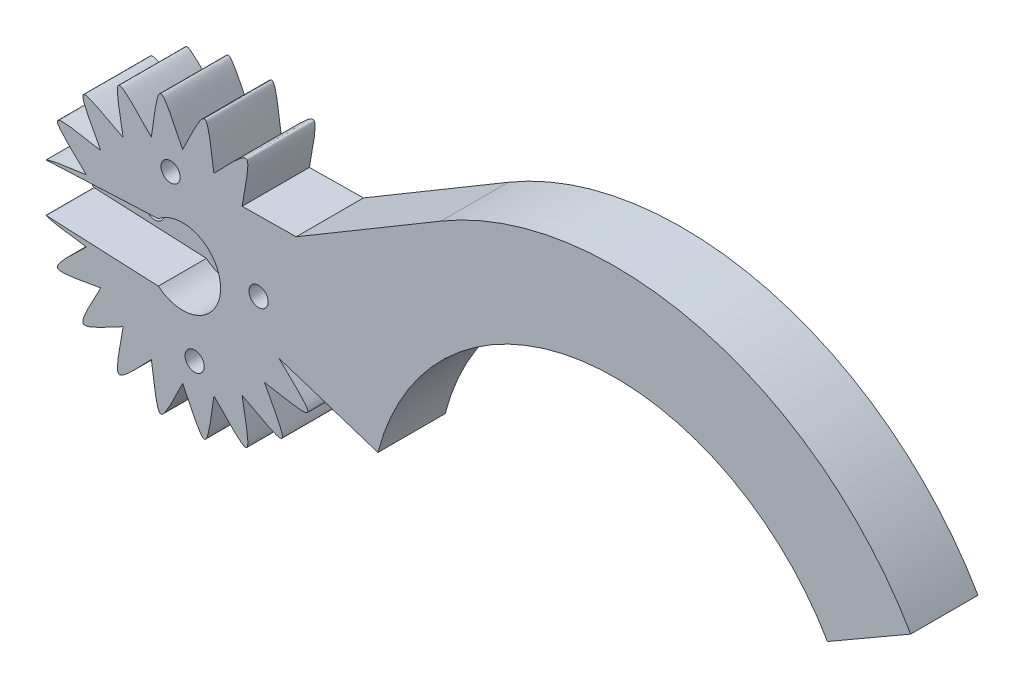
ISO-10303-21;
HEADER;
FILE_DESCRIPTION(('STEP AP214'),'2;1');
FILE_NAME('part.step','',(''),(''),'','','');
FILE_SCHEMA(('AUTOMOTIVE_DESIGN { 1 0 10303 214 1 1 1 1 }'));
ENDSEC;
DATA;
#1=APPLICATION_CONTEXT('core data for automotive mechanical design processes');
#2=APPLICATION_PROTOCOL_DEFINITION('international standard','automotive_design',2000,#1);
#3=PRODUCT_CONTEXT('',#1,'mechanical');
#4=PRODUCT('Part','Part','',(#3));
#5=PRODUCT_RELATED_PRODUCT_CATEGORY('part','',(#4));
#6=PRODUCT_DEFINITION_FORMATION('','',#4);
#7=PRODUCT_DEFINITION_CONTEXT('part definition',#1,'design');
#8=PRODUCT_DEFINITION('design','',#6,#7);
#9=PRODUCT_DEFINITION_SHAPE('','',#8);
#10=(LENGTH_UNIT() NAMED_UNIT(*) SI_UNIT(.MILLI.,.METRE.));
#11=(NAMED_UNIT(*) PLANE_ANGLE_UNIT() SI_UNIT($,.RADIAN.));
#12=(NAMED_UNIT(*) SI_UNIT($,.STERADIAN.) SOLID_ANGLE_UNIT());
#13=UNCERTAINTY_MEASURE_WITH_UNIT(LENGTH_MEASURE(1.E-05),#10,'distance_accuracy_value','');
#14=(GEOMETRIC_REPRESENTATION_CONTEXT(3) GLOBAL_UNCERTAINTY_ASSIGNED_CONTEXT((#13)) GLOBAL_UNIT_ASSIGNED_CONTEXT((#10,
#11,#12)) REPRESENTATION_CONTEXT('',''));
#15=CARTESIAN_POINT('',(0.,0.,0.));
#16=DIRECTION('',(0.,0.,1.));
#17=DIRECTION('',(1.,0.,0.));
#18=AXIS2_PLACEMENT_3D('',#15,#16,#17);
#19=CARTESIAN_POINT('',(-52.9015067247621,11.7485242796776,7.));
#20=DIRECTION('',(0.,0.,-1.));
#21=DIRECTION('',(-1.,0.,0.));
#22=AXIS2_PLACEMENT_3D('',#19,#20,#21);
#23=CYLINDRICAL_SURFACE('',#22,1.);
#24=CARTESIAN_POINT('',(-52.9015067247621,11.7485242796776,0.));
#25=DIRECTION('',(0.,0.,1.));
#26=DIRECTION('',(1.,0.,0.));
#27=AXIS2_PLACEMENT_3D('',#24,#25,#26);
#28=CIRCLE('',#27,1.);
#29=CARTESIAN_POINT('',(-51.9015067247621,11.7485242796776,0.));
#30=VERTEX_POINT('',#29);
#31=EDGE_CURVE('E595',#30,#30,#28,.T.);
#32=ORIENTED_EDGE('',*,*,#31,.F.);
#33=EDGE_LOOP('',(#32));
#34=FACE_BOUND('',#33,.T.);
#35=CARTESIAN_POINT('',(-52.9015067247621,11.7485242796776,2.));
#36=DIRECTION('',(0.,0.,1.));
#37=DIRECTION('',(1.,0.,0.));
#38=AXIS2_PLACEMENT_3D('',#35,#36,#37);
#39=CIRCLE('',#38,1.);
#40=CARTESIAN_POINT('',(-51.9015067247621,11.7485242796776,2.));
#41=VERTEX_POINT('',#40);
#42=EDGE_CURVE('E757',#41,#41,#39,.T.);
#43=ORIENTED_EDGE('',*,*,#42,.T.);
#44=EDGE_LOOP('',(#43));
#45=FACE_BOUND('',#44,.T.);
#46=ADVANCED_FACE('F71',(#34,#45),#23,.F.);
#47=CARTESIAN_POINT('',(-45.0000000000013,13.,7.));
#48=DIRECTION('',(0.,0.,-1.));
#49=DIRECTION('',(-1.,0.,0.));
#50=AXIS2_PLACEMENT_3D('',#47,#48,#49);
#51=CYLINDRICAL_SURFACE('',#50,1.);
#52=CARTESIAN_POINT('',(-45.0000000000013,13.,0.));
#53=DIRECTION('',(0.,0.,1.));
#54=DIRECTION('',(1.,0.,0.));
#55=AXIS2_PLACEMENT_3D('',#52,#53,#54);
#56=CIRCLE('',#55,1.);
#57=CARTESIAN_POINT('',(-44.0000000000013,13.,0.));
#58=VERTEX_POINT('',#57);
#59=EDGE_CURVE('E598',#58,#58,#56,.T.);
#60=ORIENTED_EDGE('',*,*,#59,.F.);
#61=EDGE_LOOP('',(#60));
#62=FACE_BOUND('',#61,.T.);
#63=CARTESIAN_POINT('',(-45.0000000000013,13.,2.));
#64=DIRECTION('',(0.,0.,1.));
#65=DIRECTION('',(1.,0.,0.));
#66=AXIS2_PLACEMENT_3D('',#63,#64,#65);
#67=CIRCLE('',#66,1.);
#68=CARTESIAN_POINT('',(-44.0000000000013,13.,2.));
#69=VERTEX_POINT('',#68);
#70=EDGE_CURVE('E755',#69,#69,#67,.T.);
#71=ORIENTED_EDGE('',*,*,#70,.T.);
#72=EDGE_LOOP('',(#71));
#73=FACE_BOUND('',#72,.T.);
#74=ADVANCED_FACE('F715',(#62,#73),#51,.F.);
#75=CARTESIAN_POINT('',(-55.0142801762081,16.2538368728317,7.));
#76=CARTESIAN_POINT('',(-60.8030134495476,15.5029514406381,7.));
#77=CARTESIAN_POINT('',(-55.5296373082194,12.9999999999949,7.));
#78=(BOUNDED_CURVE() B_SPLINE_CURVE(2,(#75,#76,#77),.UNSPECIFIED.,.F.,
.F.) B_SPLINE_CURVE_WITH_KNOTS((3,3),(0.,1.),
.UNSPECIFIED.) CURVE() GEOMETRIC_REPRESENTATION_ITEM() RATIONAL_B_SPLINE_CURVE((1.,3.,1.)) REPRESENTATION_ITEM(''));
#79=DIRECTION('',(0.,0.,-1.));
#80=VECTOR('',#79,1.);
#81=SURFACE_OF_LINEAR_EXTRUSION('',#78,#80);
#82=CARTESIAN_POINT('',(-55.0142801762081,16.2538368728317,2.));
#83=CARTESIAN_POINT('',(-60.8030134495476,15.5029514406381,2.));
#84=CARTESIAN_POINT('',(-55.5296373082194,12.9999999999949,2.));
#85=(BOUNDED_CURVE() B_SPLINE_CURVE(2,(#82,#83,#84),.UNSPECIFIED.,.F.,
.F.) B_SPLINE_CURVE_WITH_KNOTS((3,3),(0.,1.),
.UNSPECIFIED.) CURVE() GEOMETRIC_REPRESENTATION_ITEM() RATIONAL_B_SPLINE_CURVE((1.,3.,1.)) REPRESENTATION_ITEM(''));
#86=CARTESIAN_POINT('',(-59.2132458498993,15.4943053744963,2.));
#87=VERTEX_POINT('',#86);
#88=CARTESIAN_POINT('',(-55.5296373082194,12.9999999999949,2.));
#89=VERTEX_POINT('',#88);
#90=EDGE_CURVE('E460',#87,#89,#85,.T.);
#91=ORIENTED_EDGE('',*,*,#90,.F.);
#92=DIRECTION('',(0.,0.,-1.));
#93=VECTOR('',#92,1.);
#94=CARTESIAN_POINT('',(-59.2132458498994,15.4943053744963,7.));
#95=LINE('',#94,#93);
#96=CARTESIAN_POINT('',(-59.2132458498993,15.4943053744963,7.));
#97=VERTEX_POINT('',#96);
#98=EDGE_CURVE('E800',#87,#97,#95,.F.);
#99=ORIENTED_EDGE('',*,*,#98,.T.);
#100=CARTESIAN_POINT('',(-55.0142801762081,16.2538368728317,7.));
#101=VERTEX_POINT('',#100);
#102=EDGE_CURVE('E601',#101,#97,#78,.T.);
#103=ORIENTED_EDGE('',*,*,#102,.F.);
#104=DIRECTION('',(0.,0.,-1.));
#105=VECTOR('',#104,1.);
#106=CARTESIAN_POINT('',(-55.0142801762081,16.2538368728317,7.));
#107=LINE('',#106,#105);
#108=CARTESIAN_POINT('',(-55.0142801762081,16.2538368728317,0.));
#109=VERTEX_POINT('',#108);
#110=EDGE_CURVE('E459',#101,#109,#107,.T.);
#111=ORIENTED_EDGE('',*,*,#110,.T.);
#112=CARTESIAN_POINT('',(-55.0142801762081,16.2538368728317,0.));
#113=CARTESIAN_POINT('',(-60.8030134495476,15.5029514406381,0.));
#114=CARTESIAN_POINT('',(-55.5296373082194,12.9999999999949,0.));
#115=(BOUNDED_CURVE() B_SPLINE_CURVE(2,(#112,#113,#114),.UNSPECIFIED.,.F.,
.F.) B_SPLINE_CURVE_WITH_KNOTS((3,3),(0.,1.),
.UNSPECIFIED.) CURVE() GEOMETRIC_REPRESENTATION_ITEM() RATIONAL_B_SPLINE_CURVE((1.,3.,1.)) REPRESENTATION_ITEM(''));
#116=CARTESIAN_POINT('',(-55.5296373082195,12.9999999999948,0.));
#117=VERTEX_POINT('',#116);
#118=EDGE_CURVE('E454',#109,#117,#115,.T.);
#119=ORIENTED_EDGE('',*,*,#118,.T.);
#120=DIRECTION('',(0.,0.,-1.));
#121=VECTOR('',#120,1.);
#122=CARTESIAN_POINT('',(-55.5296373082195,12.9999999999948,7.));
#123=LINE('',#122,#121);
#124=EDGE_CURVE('E80',#89,#117,#123,.T.);
#125=ORIENTED_EDGE('',*,*,#124,.F.);
#126=EDGE_LOOP('',(#91,#99,#103,#111,#119,#125));
#127=FACE_BOUND('',#126,.T.);
#128=ADVANCED_FACE('F73',(#127),#81,.F.);
#129=CARTESIAN_POINT('',(-55.5296373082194,12.9999999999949,7.));
#130=CARTESIAN_POINT('',(-60.8030134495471,10.4970485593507,7.));
#131=CARTESIAN_POINT('',(-55.0142801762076,9.74616312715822,7.));
#132=(BOUNDED_CURVE() B_SPLINE_CURVE(2,(#129,#130,#131),.UNSPECIFIED.,.F.,
.F.) B_SPLINE_CURVE_WITH_KNOTS((3,3),(0.,1.),
.UNSPECIFIED.) CURVE() GEOMETRIC_REPRESENTATION_ITEM() RATIONAL_B_SPLINE_CURVE((1.,3.,1.)) REPRESENTATION_ITEM(''));
#133=DIRECTION('',(0.,0.,-1.));
#134=VECTOR('',#133,1.);
#135=SURFACE_OF_LINEAR_EXTRUSION('',#132,#134);
#136=CARTESIAN_POINT('',(-59.2132458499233,10.5056946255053,7.));
#137=VERTEX_POINT('',#136);
#138=CARTESIAN_POINT('',(-55.0142801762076,9.74616312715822,7.));
#139=VERTEX_POINT('',#138);
#140=EDGE_CURVE('E177',#137,#139,#132,.T.);
#141=ORIENTED_EDGE('',*,*,#140,.F.);
#142=DIRECTION('',(0.,0.,-1.));
#143=VECTOR('',#142,1.);
#144=CARTESIAN_POINT('',(-59.2132458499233,10.5056946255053,7.));
#145=LINE('',#144,#143);
#146=CARTESIAN_POINT('',(-59.2132458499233,10.5056946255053,2.));
#147=VERTEX_POINT('',#146);
#148=EDGE_CURVE('E86',#137,#147,#145,.T.);
#149=ORIENTED_EDGE('',*,*,#148,.T.);
#150=CARTESIAN_POINT('',(-55.5296373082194,12.9999999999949,2.));
#151=CARTESIAN_POINT('',(-60.8030134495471,10.4970485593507,2.));
#152=CARTESIAN_POINT('',(-55.0142801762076,9.74616312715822,2.));
#153=(BOUNDED_CURVE() B_SPLINE_CURVE(2,(#150,#151,#152),.UNSPECIFIED.,.F.,
.F.) B_SPLINE_CURVE_WITH_KNOTS((3,3),(0.,1.),
.UNSPECIFIED.) CURVE() GEOMETRIC_REPRESENTATION_ITEM() RATIONAL_B_SPLINE_CURVE((1.,3.,1.)) REPRESENTATION_ITEM(''));
#154=EDGE_CURVE('E445',#89,#147,#153,.T.);
#155=ORIENTED_EDGE('',*,*,#154,.F.);
#156=ORIENTED_EDGE('',*,*,#124,.T.);
#157=CARTESIAN_POINT('',(-55.5296373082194,12.9999999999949,0.));
#158=CARTESIAN_POINT('',(-60.8030134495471,10.4970485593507,0.));
#159=CARTESIAN_POINT('',(-55.0142801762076,9.74616312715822,0.));
#160=(BOUNDED_CURVE() B_SPLINE_CURVE(2,(#157,#158,#159),.UNSPECIFIED.,.F.,
.F.) B_SPLINE_CURVE_WITH_KNOTS((3,3),(0.,1.),
.UNSPECIFIED.) CURVE() GEOMETRIC_REPRESENTATION_ITEM() RATIONAL_B_SPLINE_CURVE((1.,3.,1.)) REPRESENTATION_ITEM(''));
#161=CARTESIAN_POINT('',(-55.0142801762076,9.74616312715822,0.));
#162=VERTEX_POINT('',#161);
#163=EDGE_CURVE('E443',#117,#162,#160,.T.);
#164=ORIENTED_EDGE('',*,*,#163,.T.);
#165=DIRECTION('',(0.,0.,-1.));
#166=VECTOR('',#165,1.);
#167=CARTESIAN_POINT('',(-55.0142801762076,9.74616312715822,7.));
#168=LINE('',#167,#166);
#169=EDGE_CURVE('E436',#139,#162,#168,.T.);
#170=ORIENTED_EDGE('',*,*,#169,.F.);
#171=EDGE_LOOP('',(#141,#149,#155,#156,#164,#170));
#172=FACE_BOUND('',#171,.T.);
#173=ADVANCED_FACE('F442',(#172),#135,.F.);
#174=CARTESIAN_POINT('',(-55.0142801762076,9.74616312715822,7.));
#175=CARTESIAN_POINT('',(-59.2561043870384,5.7361520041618,7.));
#176=CARTESIAN_POINT('',(-53.5186555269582,6.81083447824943,7.));
#177=(BOUNDED_CURVE() B_SPLINE_CURVE(2,(#174,#175,#176),.UNSPECIFIED.,.F.,
.F.) B_SPLINE_CURVE_WITH_KNOTS((3,3),(0.,1.),
.UNSPECIFIED.) CURVE() GEOMETRIC_REPRESENTATION_ITEM() RATIONAL_B_SPLINE_CURVE((1.,3.,1.)) REPRESENTATION_ITEM(''));
#178=DIRECTION('',(0.,0.,-1.));
#179=VECTOR('',#178,1.);
#180=SURFACE_OF_LINEAR_EXTRUSION('',#177,#179);
#181=CARTESIAN_POINT('',(-55.0142801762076,9.74616312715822,0.));
#182=CARTESIAN_POINT('',(-59.2561043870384,5.7361520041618,0.));
#183=CARTESIAN_POINT('',(-53.5186555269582,6.81083447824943,0.));
#184=(BOUNDED_CURVE() B_SPLINE_CURVE(2,(#181,#182,#183),.UNSPECIFIED.,.F.,
.F.) B_SPLINE_CURVE_WITH_KNOTS((3,3),(0.,1.),
.UNSPECIFIED.) CURVE() GEOMETRIC_REPRESENTATION_ITEM() RATIONAL_B_SPLINE_CURVE((1.,3.,1.)) REPRESENTATION_ITEM(''));
#185=CARTESIAN_POINT('',(-53.5186555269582,6.81083447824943,0.));
#186=VERTEX_POINT('',#185);
#187=EDGE_CURVE('E456',#162,#186,#184,.T.);
#188=ORIENTED_EDGE('',*,*,#187,.T.);
#189=DIRECTION('',(0.,0.,-1.));
#190=VECTOR('',#189,1.);
#191=CARTESIAN_POINT('',(-53.5186555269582,6.81083447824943,7.));
#192=LINE('',#191,#190);
#193=CARTESIAN_POINT('',(-53.5186555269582,6.81083447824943,7.));
#194=VERTEX_POINT('',#193);
#195=EDGE_CURVE('E433',#194,#186,#192,.T.);
#196=ORIENTED_EDGE('',*,*,#195,.F.);
#197=EDGE_CURVE('E653',#139,#194,#177,.T.);
#198=ORIENTED_EDGE('',*,*,#197,.F.);
#199=ORIENTED_EDGE('',*,*,#169,.T.);
#200=EDGE_LOOP('',(#188,#196,#198,#199));
#201=FACE_BOUND('',#200,.T.);
#202=ADVANCED_FACE('F652',(#201),#180,.F.);
#203=CARTESIAN_POINT('',(-53.5186555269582,6.81083447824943,7.));
#204=CARTESIAN_POINT('',(-56.313708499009,1.68629150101,7.));
#205=CARTESIAN_POINT('',(-51.1891655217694,4.48134447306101,7.));
#206=(BOUNDED_CURVE() B_SPLINE_CURVE(2,(#203,#204,#205),.UNSPECIFIED.,.F.,
.F.) B_SPLINE_CURVE_WITH_KNOTS((3,3),(0.,1.),
.UNSPECIFIED.) CURVE() GEOMETRIC_REPRESENTATION_ITEM() RATIONAL_B_SPLINE_CURVE((1.,3.,1.)) REPRESENTATION_ITEM(''));
#207=DIRECTION('',(0.,0.,-1.));
#208=VECTOR('',#207,1.);
#209=SURFACE_OF_LINEAR_EXTRUSION('',#206,#208);
#210=CARTESIAN_POINT('',(-53.5186555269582,6.81083447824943,0.));
#211=CARTESIAN_POINT('',(-56.313708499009,1.68629150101,0.));
#212=CARTESIAN_POINT('',(-51.1891655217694,4.48134447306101,0.));
#213=(BOUNDED_CURVE() B_SPLINE_CURVE(2,(#210,#211,#212),.UNSPECIFIED.,.F.,
.F.) B_SPLINE_CURVE_WITH_KNOTS((3,3),(0.,1.),
.UNSPECIFIED.) CURVE() GEOMETRIC_REPRESENTATION_ITEM() RATIONAL_B_SPLINE_CURVE((1.,3.,1.)) REPRESENTATION_ITEM(''));
#214=CARTESIAN_POINT('',(-51.1891655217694,4.48134447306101,0.));
#215=VERTEX_POINT('',#214);
#216=EDGE_CURVE('E481',#186,#215,#213,.T.);
#217=ORIENTED_EDGE('',*,*,#216,.T.);
#218=DIRECTION('',(0.,0.,-1.));
#219=VECTOR('',#218,1.);
#220=CARTESIAN_POINT('',(-51.1891655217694,4.48134447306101,7.));
#221=LINE('',#220,#219);
#222=CARTESIAN_POINT('',(-51.1891655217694,4.48134447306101,7.));
#223=VERTEX_POINT('',#222);
#224=EDGE_CURVE('E430',#223,#215,#221,.T.);
#225=ORIENTED_EDGE('',*,*,#224,.F.);
#226=EDGE_CURVE('E649',#194,#223,#206,.T.);
#227=ORIENTED_EDGE('',*,*,#226,.F.);
#228=ORIENTED_EDGE('',*,*,#195,.T.);
#229=EDGE_LOOP('',(#217,#225,#227,#228));
#230=FACE_BOUND('',#229,.T.);
#231=ADVANCED_FACE('F646',(#230),#209,.F.);
#232=CARTESIAN_POINT('',(-51.1891655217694,4.48134447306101,7.));
#233=CARTESIAN_POINT('',(-52.2638479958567,-1.25610438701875,7.));
#234=CARTESIAN_POINT('',(-48.253836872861,2.98571982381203,7.));
#235=(BOUNDED_CURVE() B_SPLINE_CURVE(2,(#232,#233,#234),.UNSPECIFIED.,.F.,
.F.) B_SPLINE_CURVE_WITH_KNOTS((3,3),(0.,1.),
.UNSPECIFIED.) CURVE() GEOMETRIC_REPRESENTATION_ITEM() RATIONAL_B_SPLINE_CURVE((1.,3.,1.)) REPRESENTATION_ITEM(''));
#236=DIRECTION('',(0.,0.,-1.));
#237=VECTOR('',#236,1.);
#238=SURFACE_OF_LINEAR_EXTRUSION('',#235,#237);
#239=CARTESIAN_POINT('',(-51.1891655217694,4.48134447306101,0.));
#240=CARTESIAN_POINT('',(-52.2638479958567,-1.25610438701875,0.));
#241=CARTESIAN_POINT('',(-48.253836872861,2.98571982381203,0.));
#242=(BOUNDED_CURVE() B_SPLINE_CURVE(2,(#239,#240,#241),.UNSPECIFIED.,.F.,
.F.) B_SPLINE_CURVE_WITH_KNOTS((3,3),(0.,1.),
.UNSPECIFIED.) CURVE() GEOMETRIC_REPRESENTATION_ITEM() RATIONAL_B_SPLINE_CURVE((1.,3.,1.)) REPRESENTATION_ITEM(''));
#243=CARTESIAN_POINT('',(-48.253836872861,2.98571982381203,0.));
#244=VERTEX_POINT('',#243);
#245=EDGE_CURVE('E488',#215,#244,#242,.T.);
#246=ORIENTED_EDGE('',*,*,#245,.T.);
#247=DIRECTION('',(0.,0.,-1.));
#248=VECTOR('',#247,1.);
#249=CARTESIAN_POINT('',(-48.253836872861,2.98571982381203,7.));
#250=LINE('',#249,#248);
#251=CARTESIAN_POINT('',(-48.253836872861,2.98571982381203,7.));
#252=VERTEX_POINT('',#251);
#253=EDGE_CURVE('E427',#252,#244,#250,.T.);
#254=ORIENTED_EDGE('',*,*,#253,.F.);
#255=EDGE_CURVE('E643',#223,#252,#235,.T.);
#256=ORIENTED_EDGE('',*,*,#255,.F.);
#257=ORIENTED_EDGE('',*,*,#224,.T.);
#258=EDGE_LOOP('',(#246,#254,#256,#257));
#259=FACE_BOUND('',#258,.T.);
#260=ADVANCED_FACE('F642',(#259),#238,.F.);
#261=CARTESIAN_POINT('',(-48.253836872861,2.98571982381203,7.));
#262=CARTESIAN_POINT('',(-47.5029514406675,-2.80301344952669,7.));
#263=CARTESIAN_POINT('',(-45.0000000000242,2.47036269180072,7.));
#264=(BOUNDED_CURVE() B_SPLINE_CURVE(2,(#261,#262,#263),.UNSPECIFIED.,.F.,
.F.) B_SPLINE_CURVE_WITH_KNOTS((3,3),(0.,1.),
.UNSPECIFIED.) CURVE() GEOMETRIC_REPRESENTATION_ITEM() RATIONAL_B_SPLINE_CURVE((1.,3.,1.)) REPRESENTATION_ITEM(''));
#265=DIRECTION('',(0.,0.,-1.));
#266=VECTOR('',#265,1.);
#267=SURFACE_OF_LINEAR_EXTRUSION('',#264,#266);
#268=CARTESIAN_POINT('',(-48.253836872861,2.98571982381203,0.));
#269=CARTESIAN_POINT('',(-47.5029514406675,-2.80301344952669,0.));
#270=CARTESIAN_POINT('',(-45.0000000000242,2.47036269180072,0.));
#271=(BOUNDED_CURVE() B_SPLINE_CURVE(2,(#268,#269,#270),.UNSPECIFIED.,.F.,
.F.) B_SPLINE_CURVE_WITH_KNOTS((3,3),(0.,1.),
.UNSPECIFIED.) CURVE() GEOMETRIC_REPRESENTATION_ITEM() RATIONAL_B_SPLINE_CURVE((1.,3.,1.)) REPRESENTATION_ITEM(''));
#272=CARTESIAN_POINT('',(-45.0000000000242,2.47036269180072,0.));
#273=VERTEX_POINT('',#272);
#274=EDGE_CURVE('E495',#244,#273,#271,.T.);
#275=ORIENTED_EDGE('',*,*,#274,.T.);
#276=DIRECTION('',(0.,0.,-1.));
#277=VECTOR('',#276,1.);
#278=CARTESIAN_POINT('',(-45.0000000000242,2.47036269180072,7.));
#279=LINE('',#278,#277);
#280=CARTESIAN_POINT('',(-45.0000000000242,2.47036269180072,7.));
#281=VERTEX_POINT('',#280);
#282=EDGE_CURVE('E424',#281,#273,#279,.T.);
#283=ORIENTED_EDGE('',*,*,#282,.F.);
#284=EDGE_CURVE('E638',#252,#281,#264,.T.);
#285=ORIENTED_EDGE('',*,*,#284,.F.);
#286=ORIENTED_EDGE('',*,*,#253,.T.);
#287=EDGE_LOOP('',(#275,#283,#285,#286));
#288=FACE_BOUND('',#287,.T.);
#289=ADVANCED_FACE('F637',(#288),#267,.F.);
#290=CARTESIAN_POINT('',(-45.0000000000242,2.47036269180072,7.));
#291=CARTESIAN_POINT('',(-42.4970485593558,-2.80301344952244,7.));
#292=CARTESIAN_POINT('',(-41.7461631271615,2.98571982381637,7.));
#293=(BOUNDED_CURVE() B_SPLINE_CURVE(2,(#290,#291,#292),.UNSPECIFIED.,.F.,
.F.) B_SPLINE_CURVE_WITH_KNOTS((3,3),(0.,1.),
.UNSPECIFIED.) CURVE() GEOMETRIC_REPRESENTATION_ITEM() RATIONAL_B_SPLINE_CURVE((1.,3.,1.)) REPRESENTATION_ITEM(''));
#294=DIRECTION('',(0.,0.,-1.));
#295=VECTOR('',#294,1.);
#296=SURFACE_OF_LINEAR_EXTRUSION('',#293,#295);
#297=CARTESIAN_POINT('',(-45.0000000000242,2.47036269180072,0.));
#298=CARTESIAN_POINT('',(-42.4970485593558,-2.80301344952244,0.));
#299=CARTESIAN_POINT('',(-41.7461631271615,2.98571982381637,0.));
#300=(BOUNDED_CURVE() B_SPLINE_CURVE(2,(#297,#298,#299),.UNSPECIFIED.,.F.,
.F.) B_SPLINE_CURVE_WITH_KNOTS((3,3),(0.,1.),
.UNSPECIFIED.) CURVE() GEOMETRIC_REPRESENTATION_ITEM() RATIONAL_B_SPLINE_CURVE((1.,3.,1.)) REPRESENTATION_ITEM(''));
#301=CARTESIAN_POINT('',(-41.7461631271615,2.98571982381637,0.));
#302=VERTEX_POINT('',#301);
#303=EDGE_CURVE('E502',#273,#302,#300,.T.);
#304=ORIENTED_EDGE('',*,*,#303,.T.);
#305=DIRECTION('',(0.,0.,-1.));
#306=VECTOR('',#305,1.);
#307=CARTESIAN_POINT('',(-41.7461631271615,2.98571982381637,7.));
#308=LINE('',#307,#306);
#309=CARTESIAN_POINT('',(-41.7461631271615,2.98571982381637,7.));
#310=VERTEX_POINT('',#309);
#311=EDGE_CURVE('E421',#310,#302,#308,.T.);
#312=ORIENTED_EDGE('',*,*,#311,.F.);
#313=EDGE_CURVE('E634',#281,#310,#293,.T.);
#314=ORIENTED_EDGE('',*,*,#313,.F.);
#315=ORIENTED_EDGE('',*,*,#282,.T.);
#316=EDGE_LOOP('',(#304,#312,#314,#315));
#317=FACE_BOUND('',#316,.T.);
#318=ADVANCED_FACE('F631',(#317),#296,.F.);
#319=CARTESIAN_POINT('',(-41.7461631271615,2.98571982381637,7.));
#320=CARTESIAN_POINT('',(-37.736152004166,-1.2561043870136,7.));
#321=CARTESIAN_POINT('',(-38.8108344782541,4.48134447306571,7.));
#322=(BOUNDED_CURVE() B_SPLINE_CURVE(2,(#319,#320,#321),.UNSPECIFIED.,.F.,
.F.) B_SPLINE_CURVE_WITH_KNOTS((3,3),(0.,1.),
.UNSPECIFIED.) CURVE() GEOMETRIC_REPRESENTATION_ITEM() RATIONAL_B_SPLINE_CURVE((1.,3.,1.)) REPRESENTATION_ITEM(''));
#323=DIRECTION('',(0.,0.,-1.));
#324=VECTOR('',#323,1.);
#325=SURFACE_OF_LINEAR_EXTRUSION('',#322,#324);
#326=CARTESIAN_POINT('',(-41.7461631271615,2.98571982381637,0.));
#327=CARTESIAN_POINT('',(-37.736152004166,-1.2561043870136,0.));
#328=CARTESIAN_POINT('',(-38.8108344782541,4.48134447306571,0.));
#329=(BOUNDED_CURVE() B_SPLINE_CURVE(2,(#326,#327,#328),.UNSPECIFIED.,.F.,
.F.) B_SPLINE_CURVE_WITH_KNOTS((3,3),(0.,1.),
.UNSPECIFIED.) CURVE() GEOMETRIC_REPRESENTATION_ITEM() RATIONAL_B_SPLINE_CURVE((1.,3.,1.)) REPRESENTATION_ITEM(''));
#330=CARTESIAN_POINT('',(-38.8108344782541,4.48134447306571,0.));
#331=VERTEX_POINT('',#330);
#332=EDGE_CURVE('E509',#302,#331,#329,.T.);
#333=ORIENTED_EDGE('',*,*,#332,.T.);
#334=DIRECTION('',(0.,0.,-1.));
#335=VECTOR('',#334,1.);
#336=CARTESIAN_POINT('',(-38.8108344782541,4.48134447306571,7.));
#337=LINE('',#336,#335);
#338=CARTESIAN_POINT('',(-38.8108344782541,4.48134447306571,7.));
#339=VERTEX_POINT('',#338);
#340=EDGE_CURVE('E418',#339,#331,#337,.T.);
#341=ORIENTED_EDGE('',*,*,#340,.F.);
#342=EDGE_CURVE('E625',#310,#339,#322,.T.);
#343=ORIENTED_EDGE('',*,*,#342,.F.);
#344=ORIENTED_EDGE('',*,*,#311,.T.);
#345=EDGE_LOOP('',(#333,#341,#343,#344));
#346=FACE_BOUND('',#345,.T.);
#347=ADVANCED_FACE('F624',(#346),#325,.F.);
#348=CARTESIAN_POINT('',(-38.8108344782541,4.48134447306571,7.));
#349=CARTESIAN_POINT('',(-33.6862915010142,1.68629150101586,7.));
#350=CARTESIAN_POINT('',(-36.4813444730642,6.8108344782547,7.));
#351=(BOUNDED_CURVE() B_SPLINE_CURVE(2,(#348,#349,#350),.UNSPECIFIED.,.F.,
.F.) B_SPLINE_CURVE_WITH_KNOTS((3,3),(0.,1.),
.UNSPECIFIED.) CURVE() GEOMETRIC_REPRESENTATION_ITEM() RATIONAL_B_SPLINE_CURVE((1.,3.,1.)) REPRESENTATION_ITEM(''));
#352=DIRECTION('',(0.,0.,-1.));
#353=VECTOR('',#352,1.);
#354=SURFACE_OF_LINEAR_EXTRUSION('',#351,#353);
#355=CARTESIAN_POINT('',(-38.8108344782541,4.48134447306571,0.));
#356=CARTESIAN_POINT('',(-33.6862915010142,1.68629150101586,0.));
#357=CARTESIAN_POINT('',(-36.4813444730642,6.8108344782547,0.));
#358=(BOUNDED_CURVE() B_SPLINE_CURVE(2,(#355,#356,#357),.UNSPECIFIED.,.F.,
.F.) B_SPLINE_CURVE_WITH_KNOTS((3,3),(0.,1.),
.UNSPECIFIED.) CURVE() GEOMETRIC_REPRESENTATION_ITEM() RATIONAL_B_SPLINE_CURVE((1.,3.,1.)) REPRESENTATION_ITEM(''));
#359=CARTESIAN_POINT('',(-36.4813444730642,6.8108344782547,0.));
#360=VERTEX_POINT('',#359);
#361=EDGE_CURVE('E516',#331,#360,#358,.T.);
#362=ORIENTED_EDGE('',*,*,#361,.T.);
#363=DIRECTION('',(0.,0.,-1.));
#364=VECTOR('',#363,1.);
#365=CARTESIAN_POINT('',(-36.4813444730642,6.8108344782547,7.));
#366=LINE('',#365,#364);
#367=CARTESIAN_POINT('',(-36.4813444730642,6.8108344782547,7.));
#368=VERTEX_POINT('',#367);
#369=EDGE_CURVE('E415',#368,#360,#366,.T.);
#370=ORIENTED_EDGE('',*,*,#369,.F.);
#371=EDGE_CURVE('E356',#339,#368,#351,.T.);
#372=ORIENTED_EDGE('',*,*,#371,.F.);
#373=ORIENTED_EDGE('',*,*,#340,.T.);
#374=EDGE_LOOP('',(#362,#370,#372,#373));
#375=FACE_BOUND('',#374,.T.);
#376=ADVANCED_FACE('F346',(#375),#354,.F.);
#377=CARTESIAN_POINT('',(-36.4813444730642,6.8108344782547,7.));
#378=CARTESIAN_POINT('',(-30.7438956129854,5.73615200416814,7.));
#379=CARTESIAN_POINT('',(-34.9857198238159,9.74616312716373,7.));
#380=(BOUNDED_CURVE() B_SPLINE_CURVE(2,(#377,#378,#379),.UNSPECIFIED.,.F.,
.F.) B_SPLINE_CURVE_WITH_KNOTS((3,3),(0.,1.),
.UNSPECIFIED.) CURVE() GEOMETRIC_REPRESENTATION_ITEM() RATIONAL_B_SPLINE_CURVE((1.,3.,1.)) REPRESENTATION_ITEM(''));
#381=DIRECTION('',(0.,0.,-1.));
#382=VECTOR('',#381,1.);
#383=SURFACE_OF_LINEAR_EXTRUSION('',#380,#382);
#384=CARTESIAN_POINT('',(-36.4813444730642,6.8108344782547,0.));
#385=CARTESIAN_POINT('',(-30.7438956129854,5.73615200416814,0.));
#386=CARTESIAN_POINT('',(-34.9857198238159,9.74616312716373,0.));
#387=(BOUNDED_CURVE() B_SPLINE_CURVE(2,(#384,#385,#386),.UNSPECIFIED.,.F.,
.F.) B_SPLINE_CURVE_WITH_KNOTS((3,3),(0.,1.),
.UNSPECIFIED.) CURVE() GEOMETRIC_REPRESENTATION_ITEM() RATIONAL_B_SPLINE_CURVE((1.,3.,1.)) REPRESENTATION_ITEM(''));
#388=CARTESIAN_POINT('',(-34.9857198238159,9.74616312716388,0.));
#389=VERTEX_POINT('',#388);
#390=EDGE_CURVE('E523',#360,#389,#387,.T.);
#391=ORIENTED_EDGE('',*,*,#390,.T.);
#392=DIRECTION('',(0.,0.,-1.));
#393=VECTOR('',#392,1.);
#394=CARTESIAN_POINT('',(-34.9857198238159,9.74616312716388,7.));
#395=LINE('',#394,#393);
#396=CARTESIAN_POINT('',(-34.9857198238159,9.74616312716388,7.));
#397=VERTEX_POINT('',#396);
#398=EDGE_CURVE('E413',#397,#389,#395,.T.);
#399=ORIENTED_EDGE('',*,*,#398,.F.);
#400=EDGE_CURVE('E350',#368,#397,#380,.T.);
#401=ORIENTED_EDGE('',*,*,#400,.F.);
#402=ORIENTED_EDGE('',*,*,#369,.T.);
#403=EDGE_LOOP('',(#391,#399,#401,#402));
#404=FACE_BOUND('',#403,.T.);
#405=ADVANCED_FACE('F341',(#404),#383,.F.);
#406=CARTESIAN_POINT('',(-0.476513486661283,-1.46655771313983,7.));
#407=DIRECTION('',(-0.309016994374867,-0.95105651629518,0.));
#408=DIRECTION('',(0.95105651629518,-0.309016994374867,0.));
#409=AXIS2_PLACEMENT_3D('',#406,#407,#408);
#410=PLANE('',#409);
#411=DIRECTION('',(-0.95105651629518,0.309016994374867,0.));
#412=VECTOR('',#411,1.);
#413=CARTESIAN_POINT('',(-0.476513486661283,-1.46655771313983,0.));
#414=LINE('',#413,#412);
#415=CARTESIAN_POINT('',(-24.6840713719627,6.39895464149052,0.));
#416=VERTEX_POINT('',#415);
#417=EDGE_CURVE('E531',#416,#389,#414,.T.);
#418=ORIENTED_EDGE('',*,*,#417,.F.);
#419=DIRECTION('',(0.,0.,-1.));
#420=VECTOR('',#419,1.);
#421=CARTESIAN_POINT('',(-24.6840713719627,6.39895464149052,7.));
#422=LINE('',#421,#420);
#423=CARTESIAN_POINT('',(-24.6840713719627,6.39895464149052,7.));
#424=VERTEX_POINT('',#423);
#425=EDGE_CURVE('E411',#424,#416,#422,.T.);
#426=ORIENTED_EDGE('',*,*,#425,.F.);
#427=DIRECTION('',(-0.95105651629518,0.309016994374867,0.));
#428=VECTOR('',#427,1.);
#429=CARTESIAN_POINT('',(-0.476513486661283,-1.46655771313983,7.));
#430=LINE('',#429,#428);
#431=EDGE_CURVE('E355',#424,#397,#430,.T.);
#432=ORIENTED_EDGE('',*,*,#431,.T.);
#433=ORIENTED_EDGE('',*,*,#398,.T.);
#434=EDGE_LOOP('',(#418,#426,#432,#433));
#435=FACE_BOUND('',#434,.T.);
#436=ADVANCED_FACE('F337',(#435),#410,.T.);
#437=CARTESIAN_POINT('',(0.,0.,7.));
#438=DIRECTION('',(0.,0.,-1.));
#439=DIRECTION('',(-1.,0.,0.));
#440=AXIS2_PLACEMENT_3D('',#437,#438,#439);
#441=CYLINDRICAL_SURFACE('',#440,25.5);
#442=CARTESIAN_POINT('',(0.,0.,0.));
#443=DIRECTION('',(0.,0.,1.));
#444=DIRECTION('',(1.,0.,0.));
#445=AXIS2_PLACEMENT_3D('',#442,#443,#444);
#446=CIRCLE('',#445,25.5);
#447=CARTESIAN_POINT('',(22.0836477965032,12.7499999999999,0.));
#448=VERTEX_POINT('',#447);
#449=EDGE_CURVE('E537',#448,#416,#446,.T.);
#450=ORIENTED_EDGE('',*,*,#449,.F.);
#451=DIRECTION('',(0.,0.,-1.));
#452=VECTOR('',#451,1.);
#453=CARTESIAN_POINT('',(22.0836477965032,12.7499999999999,7.));
#454=LINE('',#453,#452);
#455=CARTESIAN_POINT('',(22.0836477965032,12.7499999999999,7.));
#456=VERTEX_POINT('',#455);
#457=EDGE_CURVE('E409',#456,#448,#454,.T.);
#458=ORIENTED_EDGE('',*,*,#457,.F.);
#459=CARTESIAN_POINT('',(0.,0.,7.));
#460=DIRECTION('',(0.,0.,1.));
#461=DIRECTION('',(1.,0.,0.));
#462=AXIS2_PLACEMENT_3D('',#459,#460,#461);
#463=CIRCLE('',#462,25.5);
#464=EDGE_CURVE('E366',#456,#424,#463,.T.);
#465=ORIENTED_EDGE('',*,*,#464,.T.);
#466=ORIENTED_EDGE('',*,*,#425,.T.);
#467=EDGE_LOOP('',(#450,#458,#465,#466));
#468=FACE_BOUND('',#467,.T.);
#469=ADVANCED_FACE('F333',(#468),#441,.F.);
#470=CARTESIAN_POINT('',(0.,0.,7.));
#471=DIRECTION('',(-0.499999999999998,0.86602540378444,0.));
#472=DIRECTION('',(-0.86602540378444,-0.499999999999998,0.));
#473=AXIS2_PLACEMENT_3D('',#470,#471,#472);
#474=PLANE('',#473);
#475=DIRECTION('',(0.86602540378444,0.499999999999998,0.));
#476=VECTOR('',#475,1.);
#477=CARTESIAN_POINT('',(0.,0.,0.));
#478=LINE('',#477,#476);
#479=CARTESIAN_POINT('',(30.7439018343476,17.7499999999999,0.));
#480=VERTEX_POINT('',#479);
#481=EDGE_CURVE('E540',#448,#480,#478,.T.);
#482=ORIENTED_EDGE('',*,*,#481,.T.);
#483=DIRECTION('',(0.,0.,-1.));
#484=VECTOR('',#483,1.);
#485=CARTESIAN_POINT('',(30.7439018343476,17.7499999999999,7.));
#486=LINE('',#485,#484);
#487=CARTESIAN_POINT('',(30.7439018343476,17.7499999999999,7.));
#488=VERTEX_POINT('',#487);
#489=EDGE_CURVE('E406',#488,#480,#486,.T.);
#490=ORIENTED_EDGE('',*,*,#489,.F.);
#491=DIRECTION('',(0.86602540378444,0.499999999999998,0.));
#492=VECTOR('',#491,1.);
#493=CARTESIAN_POINT('',(0.,0.,7.));
#494=LINE('',#493,#492);
#495=EDGE_CURVE('E369',#456,#488,#494,.T.);
#496=ORIENTED_EDGE('',*,*,#495,.F.);
#497=ORIENTED_EDGE('',*,*,#457,.T.);
#498=EDGE_LOOP('',(#482,#490,#496,#497));
#499=FACE_BOUND('',#498,.T.);
#500=ADVANCED_FACE('F329',(#499),#474,.F.);
#501=CARTESIAN_POINT('',(0.,0.,7.));
#502=DIRECTION('',(0.,0.,-1.));
#503=DIRECTION('',(-1.,0.,0.));
#504=AXIS2_PLACEMENT_3D('',#501,#502,#503);
#505=CYLINDRICAL_SURFACE('',#504,35.5);
#506=CARTESIAN_POINT('',(0.,0.,0.));
#507=DIRECTION('',(0.,0.,1.));
#508=DIRECTION('',(1.,0.,0.));
#509=AXIS2_PLACEMENT_3D('',#506,#507,#508);
#510=CIRCLE('',#509,35.5);
#511=CARTESIAN_POINT('',(-18.1223197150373,30.5259156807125,0.));
#512=VERTEX_POINT('',#511);
#513=EDGE_CURVE('E542',#480,#512,#510,.T.);
#514=ORIENTED_EDGE('',*,*,#513,.T.);
#515=DIRECTION('',(0.,0.,-1.));
#516=VECTOR('',#515,1.);
#517=CARTESIAN_POINT('',(-18.1223197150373,30.5259156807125,7.));
#518=LINE('',#517,#516);
#519=CARTESIAN_POINT('',(-18.1223197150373,30.5259156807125,7.));
#520=VERTEX_POINT('',#519);
#521=EDGE_CURVE('E404',#520,#512,#518,.T.);
#522=ORIENTED_EDGE('',*,*,#521,.F.);
#523=CARTESIAN_POINT('',(0.,0.,7.));
#524=DIRECTION('',(0.,0.,1.));
#525=DIRECTION('',(1.,0.,0.));
#526=AXIS2_PLACEMENT_3D('',#523,#524,#525);
#527=CIRCLE('',#526,35.5);
#528=EDGE_CURVE('E371',#488,#520,#527,.T.);
#529=ORIENTED_EDGE('',*,*,#528,.F.);
#530=ORIENTED_EDGE('',*,*,#489,.T.);
#531=EDGE_LOOP('',(#514,#522,#529,#530));
#532=FACE_BOUND('',#531,.T.);
#533=ADVANCED_FACE('F325',(#532),#505,.T.);
#534=CARTESIAN_POINT('',(-18.1223197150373,30.5259156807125,7.));
#535=DIRECTION('',(-0.510487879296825,0.859884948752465,0.));
#536=DIRECTION('',(-0.859884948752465,-0.510487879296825,0.));
#537=AXIS2_PLACEMENT_3D('',#534,#535,#536);
#538=PLANE('',#537);
#539=DIRECTION('',(0.859884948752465,0.510487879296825,0.));
#540=VECTOR('',#539,1.);
#541=CARTESIAN_POINT('',(-18.1223197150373,30.5259156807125,0.));
#542=LINE('',#541,#540);
#543=CARTESIAN_POINT('',(-33.1883518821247,21.5816646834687,0.));
#544=VERTEX_POINT('',#543);
#545=EDGE_CURVE('E545',#544,#512,#542,.T.);
#546=ORIENTED_EDGE('',*,*,#545,.F.);
#547=DIRECTION('',(0.,0.,-1.));
#548=VECTOR('',#547,1.);
#549=CARTESIAN_POINT('',(-33.1883518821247,21.5816646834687,7.));
#550=LINE('',#549,#548);
#551=CARTESIAN_POINT('',(-33.1883518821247,21.5816646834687,7.));
#552=VERTEX_POINT('',#551);
#553=EDGE_CURVE('E384',#552,#544,#550,.T.);
#554=ORIENTED_EDGE('',*,*,#553,.F.);
#555=DIRECTION('',(0.859884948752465,0.510487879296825,0.));
#556=VECTOR('',#555,1.);
#557=CARTESIAN_POINT('',(-18.1223197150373,30.5259156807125,7.));
#558=LINE('',#557,#556);
#559=EDGE_CURVE('E372',#552,#520,#558,.T.);
#560=ORIENTED_EDGE('',*,*,#559,.T.);
#561=ORIENTED_EDGE('',*,*,#521,.T.);
#562=EDGE_LOOP('',(#546,#554,#560,#561));
#563=FACE_BOUND('',#562,.T.);
#564=ADVANCED_FACE('F321',(#563),#538,.T.);
#565=CARTESIAN_POINT('',(-0.245995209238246,21.9508379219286,7.));
#566=DIRECTION('',(0.0112059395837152,-0.999937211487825,0.));
#567=DIRECTION('',(0.999937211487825,0.0112059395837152,0.));
#568=AXIS2_PLACEMENT_3D('',#565,#566,#567);
#569=PLANE('',#568);
#570=DIRECTION('',(-0.999937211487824,-0.0112059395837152,0.));
#571=VECTOR('',#570,1.);
#572=CARTESIAN_POINT('',(-0.245995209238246,21.9508379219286,0.));
#573=LINE('',#572,#571);
#574=CARTESIAN_POINT('',(-38.8108344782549,21.5186555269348,0.));
#575=VERTEX_POINT('',#574);
#576=EDGE_CURVE('E382',#544,#575,#573,.T.);
#577=ORIENTED_EDGE('',*,*,#576,.T.);
#578=DIRECTION('',(0.,0.,-1.));
#579=VECTOR('',#578,1.);
#580=CARTESIAN_POINT('',(-38.8108344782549,21.5186555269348,7.));
#581=LINE('',#580,#579);
#582=CARTESIAN_POINT('',(-38.8108344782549,21.5186555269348,7.));
#583=VERTEX_POINT('',#582);
#584=EDGE_CURVE('E380',#583,#575,#581,.T.);
#585=ORIENTED_EDGE('',*,*,#584,.F.);
#586=DIRECTION('',(-0.999937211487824,-0.0112059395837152,0.));
#587=VECTOR('',#586,1.);
#588=CARTESIAN_POINT('',(-0.245995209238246,21.9508379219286,7.));
#589=LINE('',#588,#587);
#590=EDGE_CURVE('E309',#552,#583,#589,.T.);
#591=ORIENTED_EDGE('',*,*,#590,.F.);
#592=ORIENTED_EDGE('',*,*,#553,.T.);
#593=EDGE_LOOP('',(#577,#585,#591,#592));
#594=FACE_BOUND('',#593,.T.);
#595=ADVANCED_FACE('F317',(#594),#569,.F.);
#596=CARTESIAN_POINT('',(-38.8108344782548,21.5186555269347,7.));
#597=CARTESIAN_POINT('',(-37.7361520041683,27.2561043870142,7.));
#598=CARTESIAN_POINT('',(-41.7461631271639,23.0142801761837,7.));
#599=(BOUNDED_CURVE() B_SPLINE_CURVE(2,(#596,#597,#598),.UNSPECIFIED.,.F.,
.F.) B_SPLINE_CURVE_WITH_KNOTS((3,3),(0.,1.),
.UNSPECIFIED.) CURVE() GEOMETRIC_REPRESENTATION_ITEM() RATIONAL_B_SPLINE_CURVE((1.,3.,1.)) REPRESENTATION_ITEM(''));
#600=DIRECTION('',(0.,0.,-1.));
#601=VECTOR('',#600,1.);
#602=SURFACE_OF_LINEAR_EXTRUSION('',#599,#601);
#603=CARTESIAN_POINT('',(-38.8108344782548,21.5186555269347,0.));
#604=CARTESIAN_POINT('',(-37.7361520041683,27.2561043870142,0.));
#605=CARTESIAN_POINT('',(-41.7461631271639,23.0142801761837,0.));
#606=(BOUNDED_CURVE() B_SPLINE_CURVE(2,(#603,#604,#605),.UNSPECIFIED.,.F.,
.F.) B_SPLINE_CURVE_WITH_KNOTS((3,3),(0.,1.),
.UNSPECIFIED.) CURVE() GEOMETRIC_REPRESENTATION_ITEM() RATIONAL_B_SPLINE_CURVE((1.,3.,1.)) REPRESENTATION_ITEM(''));
#607=CARTESIAN_POINT('',(-41.7461631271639,23.0142801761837,0.));
#608=VERTEX_POINT('',#607);
#609=EDGE_CURVE('E389',#575,#608,#606,.T.);
#610=ORIENTED_EDGE('',*,*,#609,.T.);
#611=DIRECTION('',(0.,0.,-1.));
#612=VECTOR('',#611,1.);
#613=CARTESIAN_POINT('',(-41.7461631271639,23.0142801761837,7.));
#614=LINE('',#613,#612);
#615=CARTESIAN_POINT('',(-41.7461631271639,23.0142801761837,7.));
#616=VERTEX_POINT('',#615);
#617=EDGE_CURVE('E385',#616,#608,#614,.T.);
#618=ORIENTED_EDGE('',*,*,#617,.F.);
#619=EDGE_CURVE('E301',#583,#616,#599,.T.);
#620=ORIENTED_EDGE('',*,*,#619,.F.);
#621=ORIENTED_EDGE('',*,*,#584,.T.);
#622=EDGE_LOOP('',(#610,#618,#620,#621));
#623=FACE_BOUND('',#622,.T.);
#624=ADVANCED_FACE('F314',(#623),#602,.F.);
#625=CARTESIAN_POINT('',(-41.7461631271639,23.0142801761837,7.));
#626=CARTESIAN_POINT('',(-42.4970485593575,28.8030134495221,7.));
#627=CARTESIAN_POINT('',(-45.0000000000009,23.529637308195,7.));
#628=(BOUNDED_CURVE() B_SPLINE_CURVE(2,(#625,#626,#627),.UNSPECIFIED.,.F.,
.F.) B_SPLINE_CURVE_WITH_KNOTS((3,3),(0.,1.),
.UNSPECIFIED.) CURVE() GEOMETRIC_REPRESENTATION_ITEM() RATIONAL_B_SPLINE_CURVE((1.,3.,1.)) REPRESENTATION_ITEM(''));
#629=DIRECTION('',(0.,0.,-1.));
#630=VECTOR('',#629,1.);
#631=SURFACE_OF_LINEAR_EXTRUSION('',#628,#630);
#632=CARTESIAN_POINT('',(-41.7461631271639,23.0142801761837,0.));
#633=CARTESIAN_POINT('',(-42.4970485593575,28.8030134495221,0.));
#634=CARTESIAN_POINT('',(-45.0000000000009,23.529637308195,0.));
#635=(BOUNDED_CURVE() B_SPLINE_CURVE(2,(#632,#633,#634),.UNSPECIFIED.,.F.,
.F.) B_SPLINE_CURVE_WITH_KNOTS((3,3),(0.,1.),
.UNSPECIFIED.) CURVE() GEOMETRIC_REPRESENTATION_ITEM() RATIONAL_B_SPLINE_CURVE((1.,3.,1.)) REPRESENTATION_ITEM(''));
#636=CARTESIAN_POINT('',(-45.0000000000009,23.529637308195,0.));
#637=VERTEX_POINT('',#636);
#638=EDGE_CURVE('E396',#608,#637,#635,.T.);
#639=ORIENTED_EDGE('',*,*,#638,.T.);
#640=DIRECTION('',(0.,0.,-1.));
#641=VECTOR('',#640,1.);
#642=CARTESIAN_POINT('',(-45.0000000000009,23.529637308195,7.));
#643=LINE('',#642,#641);
#644=CARTESIAN_POINT('',(-45.0000000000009,23.529637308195,7.));
#645=VERTEX_POINT('',#644);
#646=EDGE_CURVE('E392',#645,#637,#643,.T.);
#647=ORIENTED_EDGE('',*,*,#646,.F.);
#648=EDGE_CURVE('E293',#616,#645,#628,.T.);
#649=ORIENTED_EDGE('',*,*,#648,.F.);
#650=ORIENTED_EDGE('',*,*,#617,.T.);
#651=EDGE_LOOP('',(#639,#647,#649,#650));
#652=FACE_BOUND('',#651,.T.);
#653=ADVANCED_FACE('F286',(#652),#631,.F.);
#654=CARTESIAN_POINT('',(-45.0000000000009,23.529637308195,7.));
#655=CARTESIAN_POINT('',(-47.5029514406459,28.8030134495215,7.));
#656=CARTESIAN_POINT('',(-48.253836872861,23.0142801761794,7.));
#657=(BOUNDED_CURVE() B_SPLINE_CURVE(2,(#654,#655,#656),.UNSPECIFIED.,.F.,
.F.) B_SPLINE_CURVE_WITH_KNOTS((3,3),(0.,1.),
.UNSPECIFIED.) CURVE() GEOMETRIC_REPRESENTATION_ITEM() RATIONAL_B_SPLINE_CURVE((1.,3.,1.)) REPRESENTATION_ITEM(''));
#658=DIRECTION('',(0.,0.,-1.));
#659=VECTOR('',#658,1.);
#660=SURFACE_OF_LINEAR_EXTRUSION('',#657,#659);
#661=CARTESIAN_POINT('',(-45.0000000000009,23.529637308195,0.));
#662=CARTESIAN_POINT('',(-47.5029514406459,28.8030134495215,0.));
#663=CARTESIAN_POINT('',(-48.253836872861,23.0142801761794,0.));
#664=(BOUNDED_CURVE() B_SPLINE_CURVE(2,(#661,#662,#663),.UNSPECIFIED.,.F.,
.F.) B_SPLINE_CURVE_WITH_KNOTS((3,3),(0.,1.),
.UNSPECIFIED.) CURVE() GEOMETRIC_REPRESENTATION_ITEM() RATIONAL_B_SPLINE_CURVE((1.,3.,1.)) REPRESENTATION_ITEM(''));
#665=CARTESIAN_POINT('',(-48.253836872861,23.0142801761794,0.));
#666=VERTEX_POINT('',#665);
#667=EDGE_CURVE('E399',#637,#666,#664,.T.);
#668=ORIENTED_EDGE('',*,*,#667,.T.);
#669=DIRECTION('',(0.,0.,-1.));
#670=VECTOR('',#669,1.);
#671=CARTESIAN_POINT('',(-48.253836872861,23.0142801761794,7.));
#672=LINE('',#671,#670);
#673=CARTESIAN_POINT('',(-48.253836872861,23.0142801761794,7.));
#674=VERTEX_POINT('',#673);
#675=EDGE_CURVE('E253',#674,#666,#672,.T.);
#676=ORIENTED_EDGE('',*,*,#675,.F.);
#677=EDGE_CURVE('E241',#645,#674,#657,.T.);
#678=ORIENTED_EDGE('',*,*,#677,.F.);
#679=ORIENTED_EDGE('',*,*,#646,.T.);
#680=EDGE_LOOP('',(#668,#676,#678,#679));
#681=FACE_BOUND('',#680,.T.);
#682=ADVANCED_FACE('F283',(#681),#660,.F.);
#683=CARTESIAN_POINT('',(-48.253836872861,23.0142801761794,7.));
#684=CARTESIAN_POINT('',(-52.2638479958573,27.2561043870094,7.));
#685=CARTESIAN_POINT('',(-51.1891655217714,21.5186555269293,7.));
#686=(BOUNDED_CURVE() B_SPLINE_CURVE(2,(#683,#684,#685),.UNSPECIFIED.,.F.,
.F.) B_SPLINE_CURVE_WITH_KNOTS((3,3),(0.,1.),
.UNSPECIFIED.) CURVE() GEOMETRIC_REPRESENTATION_ITEM() RATIONAL_B_SPLINE_CURVE((1.,3.,1.)) REPRESENTATION_ITEM(''));
#687=DIRECTION('',(0.,0.,-1.));
#688=VECTOR('',#687,1.);
#689=SURFACE_OF_LINEAR_EXTRUSION('',#686,#688);
#690=CARTESIAN_POINT('',(-48.253836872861,23.0142801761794,0.));
#691=CARTESIAN_POINT('',(-52.2638479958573,27.2561043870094,0.));
#692=CARTESIAN_POINT('',(-51.1891655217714,21.5186555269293,0.));
#693=(BOUNDED_CURVE() B_SPLINE_CURVE(2,(#690,#691,#692),.UNSPECIFIED.,.F.,
.F.) B_SPLINE_CURVE_WITH_KNOTS((3,3),(0.,1.),
.UNSPECIFIED.) CURVE() GEOMETRIC_REPRESENTATION_ITEM() RATIONAL_B_SPLINE_CURVE((1.,3.,1.)) REPRESENTATION_ITEM(''));
#694=CARTESIAN_POINT('',(-51.1891655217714,21.5186555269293,0.));
#695=VERTEX_POINT('',#694);
#696=EDGE_CURVE('E250',#666,#695,#693,.T.);
#697=ORIENTED_EDGE('',*,*,#696,.T.);
#698=DIRECTION('',(0.,0.,-1.));
#699=VECTOR('',#698,1.);
#700=CARTESIAN_POINT('',(-51.1891655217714,21.5186555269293,7.));
#701=LINE('',#700,#699);
#702=CARTESIAN_POINT('',(-51.1891655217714,21.5186555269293,7.));
#703=VERTEX_POINT('',#702);
#704=EDGE_CURVE('E247',#703,#695,#701,.T.);
#705=ORIENTED_EDGE('',*,*,#704,.F.);
#706=EDGE_CURVE('E232',#674,#703,#686,.T.);
#707=ORIENTED_EDGE('',*,*,#706,.F.);
#708=ORIENTED_EDGE('',*,*,#675,.T.);
#709=EDGE_LOOP('',(#697,#705,#707,#708));
#710=FACE_BOUND('',#709,.T.);
#711=ADVANCED_FACE('F248',(#710),#689,.F.);
#712=CARTESIAN_POINT('',(-51.1891655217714,21.5186555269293,7.));
#713=CARTESIAN_POINT('',(-56.3137084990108,24.3137084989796,7.));
#714=CARTESIAN_POINT('',(-53.5186555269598,19.1891655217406,7.));
#715=(BOUNDED_CURVE() B_SPLINE_CURVE(2,(#712,#713,#714),.UNSPECIFIED.,.F.,
.F.) B_SPLINE_CURVE_WITH_KNOTS((3,3),(0.,1.),
.UNSPECIFIED.) CURVE() GEOMETRIC_REPRESENTATION_ITEM() RATIONAL_B_SPLINE_CURVE((1.,3.,1.)) REPRESENTATION_ITEM(''));
#716=DIRECTION('',(0.,0.,-1.));
#717=VECTOR('',#716,1.);
#718=SURFACE_OF_LINEAR_EXTRUSION('',#715,#717);
#719=CARTESIAN_POINT('',(-51.1891655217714,21.5186555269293,0.));
#720=CARTESIAN_POINT('',(-56.3137084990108,24.3137084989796,0.));
#721=CARTESIAN_POINT('',(-53.5186555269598,19.1891655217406,0.));
#722=(BOUNDED_CURVE() B_SPLINE_CURVE(2,(#719,#720,#721),.UNSPECIFIED.,.F.,
.F.) B_SPLINE_CURVE_WITH_KNOTS((3,3),(0.,1.),
.UNSPECIFIED.) CURVE() GEOMETRIC_REPRESENTATION_ITEM() RATIONAL_B_SPLINE_CURVE((1.,3.,1.)) REPRESENTATION_ITEM(''));
#723=CARTESIAN_POINT('',(-53.5186555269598,19.1891655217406,0.));
#724=VERTEX_POINT('',#723);
#725=EDGE_CURVE('E570',#695,#724,#722,.T.);
#726=ORIENTED_EDGE('',*,*,#725,.T.);
#727=DIRECTION('',(0.,0.,-1.));
#728=VECTOR('',#727,1.);
#729=CARTESIAN_POINT('',(-53.5186555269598,19.1891655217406,7.));
#730=LINE('',#729,#728);
#731=CARTESIAN_POINT('',(-53.5186555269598,19.1891655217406,7.));
#732=VERTEX_POINT('',#731);
#733=EDGE_CURVE('E254',#732,#724,#730,.T.);
#734=ORIENTED_EDGE('',*,*,#733,.F.);
#735=EDGE_CURVE('E238',#703,#732,#715,.T.);
#736=ORIENTED_EDGE('',*,*,#735,.F.);
#737=ORIENTED_EDGE('',*,*,#704,.T.);
#738=EDGE_LOOP('',(#726,#734,#736,#737));
#739=FACE_BOUND('',#738,.T.);
#740=ADVANCED_FACE('F256',(#739),#718,.F.);
#741=CARTESIAN_POINT('',(-43.7485242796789,5.09849327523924,7.));
#742=DIRECTION('',(0.,0.,-1.));
#743=DIRECTION('',(-1.,0.,0.));
#744=AXIS2_PLACEMENT_3D('',#741,#742,#743);
#745=CYLINDRICAL_SURFACE('',#744,1.);
#746=CARTESIAN_POINT('',(-43.7485242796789,5.09849327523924,7.));
#747=DIRECTION('',(0.,0.,1.));
#748=DIRECTION('',(1.,0.,0.));
#749=AXIS2_PLACEMENT_3D('',#746,#747,#748);
#750=CIRCLE('',#749,1.);
#751=CARTESIAN_POINT('',(-42.7485242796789,5.09849327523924,7.));
#752=VERTEX_POINT('',#751);
#753=EDGE_CURVE('E467',#752,#752,#750,.T.);
#754=ORIENTED_EDGE('',*,*,#753,.T.);
#755=EDGE_LOOP('',(#754));
#756=FACE_BOUND('',#755,.T.);
#757=CARTESIAN_POINT('',(-43.7485242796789,5.09849327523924,0.));
#758=DIRECTION('',(0.,0.,1.));
#759=DIRECTION('',(1.,0.,0.));
#760=AXIS2_PLACEMENT_3D('',#757,#758,#759);
#761=CIRCLE('',#760,1.);
#762=CARTESIAN_POINT('',(-42.7485242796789,5.09849327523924,0.));
#763=VERTEX_POINT('',#762);
#764=EDGE_CURVE('E592',#763,#763,#761,.T.);
#765=ORIENTED_EDGE('',*,*,#764,.F.);
#766=EDGE_LOOP('',(#765));
#767=FACE_BOUND('',#766,.T.);
#768=ADVANCED_FACE('F278',(#756,#767),#745,.F.);
#769=CARTESIAN_POINT('',(-37.0984932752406,14.2514757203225,7.));
#770=DIRECTION('',(0.,0.,-1.));
#771=DIRECTION('',(-1.,0.,0.));
#772=AXIS2_PLACEMENT_3D('',#769,#770,#771);
#773=CYLINDRICAL_SURFACE('',#772,1.);
#774=CARTESIAN_POINT('',(-37.0984932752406,14.2514757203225,7.));
#775=DIRECTION('',(0.,0.,1.));
#776=DIRECTION('',(1.,0.,0.));
#777=AXIS2_PLACEMENT_3D('',#774,#775,#776);
#778=CIRCLE('',#777,1.);
#779=CARTESIAN_POINT('',(-36.0984932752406,14.2514757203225,7.));
#780=VERTEX_POINT('',#779);
#781=EDGE_CURVE('E1122',#780,#780,#778,.T.);
#782=ORIENTED_EDGE('',*,*,#781,.T.);
#783=EDGE_LOOP('',(#782));
#784=FACE_BOUND('',#783,.T.);
#785=CARTESIAN_POINT('',(-37.0984932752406,14.2514757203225,0.));
#786=DIRECTION('',(0.,0.,1.));
#787=DIRECTION('',(1.,0.,0.));
#788=AXIS2_PLACEMENT_3D('',#785,#786,#787);
#789=CIRCLE('',#788,1.);
#790=CARTESIAN_POINT('',(-36.0984932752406,14.2514757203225,0.));
#791=VERTEX_POINT('',#790);
#792=EDGE_CURVE('E589',#791,#791,#789,.T.);
#793=ORIENTED_EDGE('',*,*,#792,.F.);
#794=EDGE_LOOP('',(#793));
#795=FACE_BOUND('',#794,.T.);
#796=ADVANCED_FACE('F730',(#784,#795),#773,.F.);
#797=CARTESIAN_POINT('',(-46.2514757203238,20.9015067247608,7.));
#798=DIRECTION('',(0.,0.,-1.));
#799=DIRECTION('',(-1.,0.,0.));
#800=AXIS2_PLACEMENT_3D('',#797,#798,#799);
#801=CYLINDRICAL_SURFACE('',#800,0.999999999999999);
#802=CARTESIAN_POINT('',(-46.2514757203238,20.9015067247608,7.));
#803=DIRECTION('',(0.,0.,1.));
#804=DIRECTION('',(1.,0.,0.));
#805=AXIS2_PLACEMENT_3D('',#802,#803,#804);
#806=CIRCLE('',#805,0.999999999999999);
#807=CARTESIAN_POINT('',(-45.2514757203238,20.9015067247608,7.));
#808=VERTEX_POINT('',#807);
#809=EDGE_CURVE('E258',#808,#808,#806,.T.);
#810=ORIENTED_EDGE('',*,*,#809,.T.);
#811=EDGE_LOOP('',(#810));
#812=FACE_BOUND('',#811,.T.);
#813=CARTESIAN_POINT('',(-46.2514757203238,20.9015067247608,0.));
#814=DIRECTION('',(0.,0.,1.));
#815=DIRECTION('',(1.,0.,0.));
#816=AXIS2_PLACEMENT_3D('',#813,#814,#815);
#817=CIRCLE('',#816,0.999999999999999);
#818=CARTESIAN_POINT('',(-45.2514757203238,20.9015067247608,0.));
#819=VERTEX_POINT('',#818);
#820=EDGE_CURVE('E583',#819,#819,#817,.T.);
#821=ORIENTED_EDGE('',*,*,#820,.F.);
#822=EDGE_LOOP('',(#821));
#823=FACE_BOUND('',#822,.T.);
#824=ADVANCED_FACE('F733',(#812,#823),#801,.F.);
#825=CARTESIAN_POINT('',(-53.5186555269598,19.1891655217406,7.));
#826=CARTESIAN_POINT('',(-59.2561043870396,20.2638479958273,7.));
#827=CARTESIAN_POINT('',(-55.0142801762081,16.2538368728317,7.));
#828=(BOUNDED_CURVE() B_SPLINE_CURVE(2,(#825,#826,#827),.UNSPECIFIED.,.F.,
.F.) B_SPLINE_CURVE_WITH_KNOTS((3,3),(0.,1.),
.UNSPECIFIED.) CURVE() GEOMETRIC_REPRESENTATION_ITEM() RATIONAL_B_SPLINE_CURVE((1.,3.,1.)) REPRESENTATION_ITEM(''));
#829=DIRECTION('',(0.,0.,-1.));
#830=VECTOR('',#829,1.);
#831=SURFACE_OF_LINEAR_EXTRUSION('',#828,#830);
#832=CARTESIAN_POINT('',(-53.5186555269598,19.1891655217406,0.));
#833=CARTESIAN_POINT('',(-59.2561043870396,20.2638479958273,0.));
#834=CARTESIAN_POINT('',(-55.0142801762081,16.2538368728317,0.));
#835=(BOUNDED_CURVE() B_SPLINE_CURVE(2,(#832,#833,#834),.UNSPECIFIED.,.F.,
.F.) B_SPLINE_CURVE_WITH_KNOTS((3,3),(0.,1.),
.UNSPECIFIED.) CURVE() GEOMETRIC_REPRESENTATION_ITEM() RATIONAL_B_SPLINE_CURVE((1.,3.,1.)) REPRESENTATION_ITEM(''));
#836=EDGE_CURVE('E170',#724,#109,#835,.T.);
#837=ORIENTED_EDGE('',*,*,#836,.T.);
#838=ORIENTED_EDGE('',*,*,#110,.F.);
#839=EDGE_CURVE('E95',#732,#101,#828,.T.);
#840=ORIENTED_EDGE('',*,*,#839,.F.);
#841=ORIENTED_EDGE('',*,*,#733,.T.);
#842=EDGE_LOOP('',(#837,#838,#840,#841));
#843=FACE_BOUND('',#842,.T.);
#844=ADVANCED_FACE('F279',(#843),#831,.F.);
#845=CARTESIAN_POINT('',(0.,0.,7.));
#846=DIRECTION('',(0.,0.,1.));
#847=DIRECTION('',(1.,0.,0.));
#848=AXIS2_PLACEMENT_3D('',#845,#846,#847);
#849=PLANE('',#848);
#850=CARTESIAN_POINT('',(-59.0500000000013,13.,7.));
#851=DIRECTION('',(0.,0.,1.));
#852=DIRECTION('',(1.,0.,0.));
#853=AXIS2_PLACEMENT_3D('',#850,#851,#852);
#854=CIRCLE('',#853,2.49964167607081);
#855=CARTESIAN_POINT('',(-59.1652512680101,15.4969833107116,7.));
#856=VERTEX_POINT('',#855);
#857=EDGE_CURVE('E767',#856,#97,#854,.T.);
#858=ORIENTED_EDGE('',*,*,#857,.F.);
#859=DIRECTION('',(0.998936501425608,0.0461071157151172,0.));
#860=VECTOR('',#859,1.);
#861=CARTESIAN_POINT('',(-0.839538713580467,18.1890767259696,7.));
#862=LINE('',#861,#860);
#863=CARTESIAN_POINT('',(-47.5292275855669,16.0340579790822,7.));
#864=VERTEX_POINT('',#863);
#865=EDGE_CURVE('E760',#856,#864,#862,.T.);
#866=ORIENTED_EDGE('',*,*,#865,.T.);
#867=CARTESIAN_POINT('',(-45.0000000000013,13.,7.));
#868=DIRECTION('',(0.,0.,1.));
#869=DIRECTION('',(1.,0.,0.));
#870=AXIS2_PLACEMENT_3D('',#867,#868,#869);
#871=CIRCLE('',#870,3.95000000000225);
#872=CARTESIAN_POINT('',(-47.529227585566,9.96594202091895,7.));
#873=VERTEX_POINT('',#872);
#874=EDGE_CURVE('E780',#873,#864,#871,.T.);
#875=ORIENTED_EDGE('',*,*,#874,.F.);
#876=DIRECTION('',(-0.998936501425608,0.0461071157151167,0.));
#877=VECTOR('',#876,1.);
#878=CARTESIAN_POINT('',(0.357971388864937,7.75565075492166,7.));
#879=LINE('',#878,#877);
#880=CARTESIAN_POINT('',(-59.1652512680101,10.5030166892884,7.));
#881=VERTEX_POINT('',#880);
#882=EDGE_CURVE('E783',#873,#881,#879,.T.);
#883=ORIENTED_EDGE('',*,*,#882,.T.);
#884=CARTESIAN_POINT('',(-59.0500000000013,13.,7.));
#885=DIRECTION('',(0.,0.,1.));
#886=DIRECTION('',(1.,0.,0.));
#887=AXIS2_PLACEMENT_3D('',#884,#885,#886);
#888=CIRCLE('',#887,2.49964167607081);
#889=EDGE_CURVE('E12',#137,#881,#888,.T.);
#890=ORIENTED_EDGE('',*,*,#889,.F.);
#891=ORIENTED_EDGE('',*,*,#140,.T.);
#892=ORIENTED_EDGE('',*,*,#197,.T.);
#893=ORIENTED_EDGE('',*,*,#226,.T.);
#894=ORIENTED_EDGE('',*,*,#255,.T.);
#895=ORIENTED_EDGE('',*,*,#284,.T.);
#896=ORIENTED_EDGE('',*,*,#313,.T.);
#897=ORIENTED_EDGE('',*,*,#342,.T.);
#898=ORIENTED_EDGE('',*,*,#371,.T.);
#899=ORIENTED_EDGE('',*,*,#400,.T.);
#900=ORIENTED_EDGE('',*,*,#431,.F.);
#901=ORIENTED_EDGE('',*,*,#464,.F.);
#902=ORIENTED_EDGE('',*,*,#495,.T.);
#903=ORIENTED_EDGE('',*,*,#528,.T.);
#904=ORIENTED_EDGE('',*,*,#559,.F.);
#905=ORIENTED_EDGE('',*,*,#590,.T.);
#906=ORIENTED_EDGE('',*,*,#619,.T.);
#907=ORIENTED_EDGE('',*,*,#648,.T.);
#908=ORIENTED_EDGE('',*,*,#677,.T.);
#909=ORIENTED_EDGE('',*,*,#706,.T.);
#910=ORIENTED_EDGE('',*,*,#735,.T.);
#911=ORIENTED_EDGE('',*,*,#839,.T.);
#912=ORIENTED_EDGE('',*,*,#102,.T.);
#913=EDGE_LOOP('',(#858,#866,#875,#883,#890,#891,#892,#893,#894,#895,#896,#897,#898,#899,#900,
#901,#902,#903,#904,#905,#906,#907,#908,#909,#910,#911,#912));
#914=FACE_BOUND('',#913,.T.);
#915=ORIENTED_EDGE('',*,*,#809,.F.);
#916=EDGE_LOOP('',(#915));
#917=FACE_BOUND('',#916,.T.);
#918=ORIENTED_EDGE('',*,*,#781,.F.);
#919=EDGE_LOOP('',(#918));
#920=FACE_BOUND('',#919,.T.);
#921=ORIENTED_EDGE('',*,*,#753,.F.);
#922=EDGE_LOOP('',(#921));
#923=FACE_BOUND('',#922,.T.);
#924=ADVANCED_FACE('F235',(#914,#917,#920,#923),#849,.T.);
#925=CARTESIAN_POINT('',(0.,0.,0.));
#926=DIRECTION('',(0.,0.,1.));
#927=DIRECTION('',(1.,0.,0.));
#928=AXIS2_PLACEMENT_3D('',#925,#926,#927);
#929=PLANE('',#928);
#930=ORIENTED_EDGE('',*,*,#118,.F.);
#931=ORIENTED_EDGE('',*,*,#836,.F.);
#932=ORIENTED_EDGE('',*,*,#725,.F.);
#933=ORIENTED_EDGE('',*,*,#696,.F.);
#934=ORIENTED_EDGE('',*,*,#667,.F.);
#935=ORIENTED_EDGE('',*,*,#638,.F.);
#936=ORIENTED_EDGE('',*,*,#609,.F.);
#937=ORIENTED_EDGE('',*,*,#576,.F.);
#938=ORIENTED_EDGE('',*,*,#545,.T.);
#939=ORIENTED_EDGE('',*,*,#513,.F.);
#940=ORIENTED_EDGE('',*,*,#481,.F.);
#941=ORIENTED_EDGE('',*,*,#449,.T.);
#942=ORIENTED_EDGE('',*,*,#417,.T.);
#943=ORIENTED_EDGE('',*,*,#390,.F.);
#944=ORIENTED_EDGE('',*,*,#361,.F.);
#945=ORIENTED_EDGE('',*,*,#332,.F.);
#946=ORIENTED_EDGE('',*,*,#303,.F.);
#947=ORIENTED_EDGE('',*,*,#274,.F.);
#948=ORIENTED_EDGE('',*,*,#245,.F.);
#949=ORIENTED_EDGE('',*,*,#216,.F.);
#950=ORIENTED_EDGE('',*,*,#187,.F.);
#951=ORIENTED_EDGE('',*,*,#163,.F.);
#952=EDGE_LOOP('',(#930,#931,#932,#933,#934,#935,#936,#937,#938,#939,#940,#941,#942,#943,#944,
#945,#946,#947,#948,#949,#950,#951));
#953=FACE_BOUND('',#952,.T.);
#954=ORIENTED_EDGE('',*,*,#820,.T.);
#955=EDGE_LOOP('',(#954));
#956=FACE_BOUND('',#955,.T.);
#957=ORIENTED_EDGE('',*,*,#792,.T.);
#958=EDGE_LOOP('',(#957));
#959=FACE_BOUND('',#958,.T.);
#960=ORIENTED_EDGE('',*,*,#764,.T.);
#961=EDGE_LOOP('',(#960));
#962=FACE_BOUND('',#961,.T.);
#963=ORIENTED_EDGE('',*,*,#31,.T.);
#964=EDGE_LOOP('',(#963));
#965=FACE_BOUND('',#964,.T.);
#966=ORIENTED_EDGE('',*,*,#59,.T.);
#967=EDGE_LOOP('',(#966));
#968=FACE_BOUND('',#967,.T.);
#969=ADVANCED_FACE('F452',(#953,#956,#959,#962,#965,#968),#929,.F.);
#970=CARTESIAN_POINT('',(-45.0000000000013,13.,2.));
#971=DIRECTION('',(0.,0.,1.));
#972=DIRECTION('',(1.,0.,0.));
#973=AXIS2_PLACEMENT_3D('',#970,#971,#972);
#974=PLANE('',#973);
#975=ORIENTED_EDGE('',*,*,#42,.F.);
#976=EDGE_LOOP('',(#975));
#977=FACE_BOUND('',#976,.T.);
#978=ORIENTED_EDGE('',*,*,#70,.F.);
#979=EDGE_LOOP('',(#978));
#980=FACE_BOUND('',#979,.T.);
#981=ORIENTED_EDGE('',*,*,#90,.T.);
#982=ORIENTED_EDGE('',*,*,#154,.T.);
#983=CARTESIAN_POINT('',(-59.0500000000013,13.,2.));
#984=DIRECTION('',(0.,0.,1.));
#985=DIRECTION('',(1.,0.,0.));
#986=AXIS2_PLACEMENT_3D('',#983,#984,#985);
#987=CIRCLE('',#986,2.49964167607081);
#988=CARTESIAN_POINT('',(-59.1652512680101,10.5030166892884,2.));
#989=VERTEX_POINT('',#988);
#990=EDGE_CURVE('E773',#147,#989,#987,.T.);
#991=ORIENTED_EDGE('',*,*,#990,.T.);
#992=DIRECTION('',(-0.998936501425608,0.0461071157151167,0.));
#993=VECTOR('',#992,1.);
#994=CARTESIAN_POINT('',(0.357971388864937,7.75565075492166,2.));
#995=LINE('',#994,#993);
#996=CARTESIAN_POINT('',(-47.529227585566,9.96594202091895,2.));
#997=VERTEX_POINT('',#996);
#998=EDGE_CURVE('E770',#997,#989,#995,.T.);
#999=ORIENTED_EDGE('',*,*,#998,.F.);
#1000=CARTESIAN_POINT('',(-45.0000000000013,13.,2.));
#1001=DIRECTION('',(0.,0.,1.));
#1002=DIRECTION('',(1.,0.,0.));
#1003=AXIS2_PLACEMENT_3D('',#1000,#1001,#1002);
#1004=CIRCLE('',#1003,3.95000000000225);
#1005=CARTESIAN_POINT('',(-47.5292275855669,16.0340579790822,2.));
#1006=VERTEX_POINT('',#1005);
#1007=EDGE_CURVE('E766',#997,#1006,#1004,.T.);
#1008=ORIENTED_EDGE('',*,*,#1007,.T.);
#1009=DIRECTION('',(0.998936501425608,0.0461071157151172,0.));
#1010=VECTOR('',#1009,1.);
#1011=CARTESIAN_POINT('',(-0.839538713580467,18.1890767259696,2.));
#1012=LINE('',#1011,#1010);
#1013=CARTESIAN_POINT('',(-59.1652512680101,15.4969833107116,2.));
#1014=VERTEX_POINT('',#1013);
#1015=EDGE_CURVE('E763',#1014,#1006,#1012,.T.);
#1016=ORIENTED_EDGE('',*,*,#1015,.F.);
#1017=EDGE_CURVE('E774',#1014,#87,#987,.T.);
#1018=ORIENTED_EDGE('',*,*,#1017,.T.);
#1019=EDGE_LOOP('',(#981,#982,#991,#999,#1008,#1016,#1018));
#1020=FACE_BOUND('',#1019,.T.);
#1021=ADVANCED_FACE('F745',(#977,#980,#1020),#974,.T.);
#1022=CARTESIAN_POINT('',(-59.0500000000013,13.,2.));
#1023=DIRECTION('',(0.,0.,1.));
#1024=DIRECTION('',(1.,0.,0.));
#1025=AXIS2_PLACEMENT_3D('',#1022,#1023,#1024);
#1026=CYLINDRICAL_SURFACE('',#1025,2.49964167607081);
#1027=ORIENTED_EDGE('',*,*,#1017,.F.);
#1028=DIRECTION('',(0.,0.,1.));
#1029=VECTOR('',#1028,1.);
#1030=CARTESIAN_POINT('',(-59.1652512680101,15.4969833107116,2.));
#1031=LINE('',#1030,#1029);
#1032=EDGE_CURVE('E777',#1014,#856,#1031,.T.);
#1033=ORIENTED_EDGE('',*,*,#1032,.T.);
#1034=ORIENTED_EDGE('',*,*,#857,.T.);
#1035=ORIENTED_EDGE('',*,*,#98,.F.);
#1036=EDGE_LOOP('',(#1027,#1033,#1034,#1035));
#1037=FACE_BOUND('',#1036,.T.);
#1038=ADVANCED_FACE('F850',(#1037),#1026,.F.);
#1039=ORIENTED_EDGE('',*,*,#889,.T.);
#1040=DIRECTION('',(0.,0.,1.));
#1041=VECTOR('',#1040,1.);
#1042=CARTESIAN_POINT('',(-59.1652512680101,10.5030166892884,2.));
#1043=LINE('',#1042,#1041);
#1044=EDGE_CURVE('E790',#989,#881,#1043,.T.);
#1045=ORIENTED_EDGE('',*,*,#1044,.F.);
#1046=ORIENTED_EDGE('',*,*,#990,.F.);
#1047=ORIENTED_EDGE('',*,*,#148,.F.);
#1048=EDGE_LOOP('',(#1039,#1045,#1046,#1047));
#1049=FACE_BOUND('',#1048,.T.);
#1050=ADVANCED_FACE('F819',(#1049),#1026,.F.);
#1051=CARTESIAN_POINT('',(-0.839538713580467,18.1890767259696,2.));
#1052=DIRECTION('',(0.0461071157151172,-0.998936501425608,0.));
#1053=DIRECTION('',(0.998936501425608,0.0461071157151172,0.));
#1054=AXIS2_PLACEMENT_3D('',#1051,#1052,#1053);
#1055=PLANE('',#1054);
#1056=ORIENTED_EDGE('',*,*,#865,.F.);
#1057=ORIENTED_EDGE('',*,*,#1032,.F.);
#1058=ORIENTED_EDGE('',*,*,#1015,.T.);
#1059=DIRECTION('',(0.,0.,1.));
#1060=VECTOR('',#1059,1.);
#1061=CARTESIAN_POINT('',(-47.5292275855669,16.0340579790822,2.));
#1062=LINE('',#1061,#1060);
#1063=EDGE_CURVE('E796',#1006,#864,#1062,.T.);
#1064=ORIENTED_EDGE('',*,*,#1063,.T.);
#1065=EDGE_LOOP('',(#1056,#1057,#1058,#1064));
#1066=FACE_BOUND('',#1065,.T.);
#1067=ADVANCED_FACE('F853',(#1066),#1055,.T.);
#1068=CARTESIAN_POINT('',(-45.0000000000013,13.,2.));
#1069=DIRECTION('',(0.,0.,1.));
#1070=DIRECTION('',(1.,0.,0.));
#1071=AXIS2_PLACEMENT_3D('',#1068,#1069,#1070);
#1072=CYLINDRICAL_SURFACE('',#1071,3.95000000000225);
#1073=ORIENTED_EDGE('',*,*,#874,.T.);
#1074=ORIENTED_EDGE('',*,*,#1063,.F.);
#1075=ORIENTED_EDGE('',*,*,#1007,.F.);
#1076=DIRECTION('',(0.,0.,1.));
#1077=VECTOR('',#1076,1.);
#1078=CARTESIAN_POINT('',(-47.529227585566,9.96594202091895,2.));
#1079=LINE('',#1078,#1077);
#1080=EDGE_CURVE('E793',#997,#873,#1079,.T.);
#1081=ORIENTED_EDGE('',*,*,#1080,.T.);
#1082=EDGE_LOOP('',(#1073,#1074,#1075,#1081));
#1083=FACE_BOUND('',#1082,.T.);
#1084=ADVANCED_FACE('F837',(#1083),#1072,.F.);
#1085=CARTESIAN_POINT('',(0.357971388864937,7.75565075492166,2.));
#1086=DIRECTION('',(0.0461071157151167,0.998936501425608,0.));
#1087=DIRECTION('',(-0.998936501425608,0.0461071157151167,0.));
#1088=AXIS2_PLACEMENT_3D('',#1085,#1086,#1087);
#1089=PLANE('',#1088);
#1090=ORIENTED_EDGE('',*,*,#882,.F.);
#1091=ORIENTED_EDGE('',*,*,#1080,.F.);
#1092=ORIENTED_EDGE('',*,*,#998,.T.);
#1093=ORIENTED_EDGE('',*,*,#1044,.T.);
#1094=EDGE_LOOP('',(#1090,#1091,#1092,#1093));
#1095=FACE_BOUND('',#1094,.T.);
#1096=ADVANCED_FACE('F826',(#1095),#1089,.T.);
#1097=CLOSED_SHELL('',(#46,#74,#128,#173,#202,#231,#260,#289,#318,#347,#376,#405,#436,#469,#500,
#533,#564,#595,#624,#653,#682,#711,#740,#768,#796,#824,#844,#924,#969,#1021,#1038,#1050,#1067,
#1084,#1096));
#1098=MANIFOLD_SOLID_BREP('B2',#1097);
#1099=ADVANCED_BREP_SHAPE_REPRESENTATION('',(#18,#1098),#14);
#1100=SHAPE_DEFINITION_REPRESENTATION(#9,#1099);
ENDSEC;
END-ISO-10303-21;
